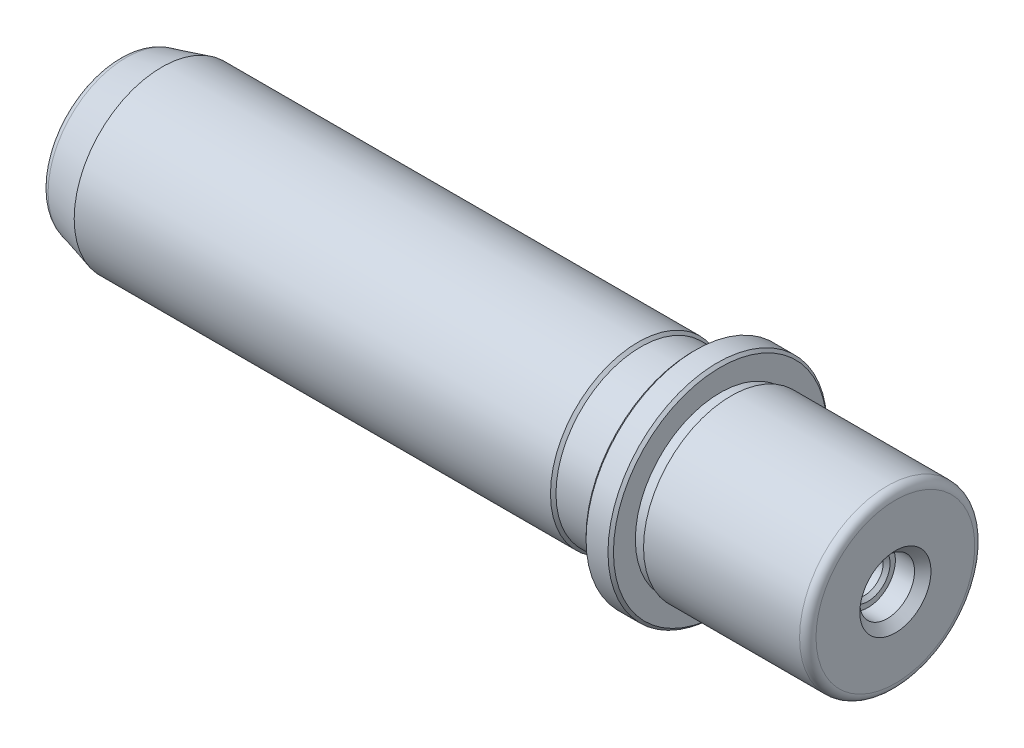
ISO-10303-21;
HEADER;
FILE_DESCRIPTION(('STEP AP214'),'2;1');
FILE_NAME('part.step','',(''),(''),'','','');
FILE_SCHEMA(('AUTOMOTIVE_DESIGN { 1 0 10303 214 1 1 1 1 }'));
ENDSEC;
DATA;
#1=APPLICATION_CONTEXT('core data for automotive mechanical design processes');
#2=APPLICATION_PROTOCOL_DEFINITION('international standard','automotive_design',2000,#1);
#3=PRODUCT_CONTEXT('',#1,'mechanical');
#4=PRODUCT('Part','Part','',(#3));
#5=PRODUCT_RELATED_PRODUCT_CATEGORY('part','',(#4));
#6=PRODUCT_DEFINITION_FORMATION('','',#4);
#7=PRODUCT_DEFINITION_CONTEXT('part definition',#1,'design');
#8=PRODUCT_DEFINITION('design','',#6,#7);
#9=PRODUCT_DEFINITION_SHAPE('','',#8);
#10=(LENGTH_UNIT() NAMED_UNIT(*) SI_UNIT(.MILLI.,.METRE.));
#11=(NAMED_UNIT(*) PLANE_ANGLE_UNIT() SI_UNIT($,.RADIAN.));
#12=(NAMED_UNIT(*) SI_UNIT($,.STERADIAN.) SOLID_ANGLE_UNIT());
#13=UNCERTAINTY_MEASURE_WITH_UNIT(LENGTH_MEASURE(1.E-05),#10,'distance_accuracy_value','');
#14=(GEOMETRIC_REPRESENTATION_CONTEXT(3) GLOBAL_UNCERTAINTY_ASSIGNED_CONTEXT((#13)) GLOBAL_UNIT_ASSIGNED_CONTEXT((#10,
#11,#12)) REPRESENTATION_CONTEXT('',''));
#15=CARTESIAN_POINT('',(0.,0.,0.));
#16=DIRECTION('',(0.,0.,1.));
#17=DIRECTION('',(1.,0.,0.));
#18=AXIS2_PLACEMENT_3D('',#15,#16,#17);
#19=CARTESIAN_POINT('',(110.,0.,0.));
#20=DIRECTION('',(-1.,0.,0.));
#21=DIRECTION('',(0.,0.,1.));
#22=AXIS2_PLACEMENT_3D('',#19,#20,#21);
#23=CONICAL_SURFACE('',#22,19.5,0.785398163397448);
#24=CARTESIAN_POINT('',(109.5,0.,0.));
#25=DIRECTION('',(-1.,0.,0.));
#26=DIRECTION('',(0.,0.,1.));
#27=AXIS2_PLACEMENT_3D('',#24,#25,#26);
#28=CIRCLE('',#27,20.);
#29=CARTESIAN_POINT('',(109.5,0.,20.));
#30=VERTEX_POINT('',#29);
#31=EDGE_CURVE('E77',#30,#30,#28,.T.);
#32=ORIENTED_EDGE('',*,*,#31,.F.);
#33=EDGE_LOOP('',(#32));
#34=FACE_BOUND('',#33,.T.);
#35=CARTESIAN_POINT('',(110.,0.,0.));
#36=DIRECTION('',(-1.,0.,0.));
#37=DIRECTION('',(0.,0.,1.));
#38=AXIS2_PLACEMENT_3D('',#35,#36,#37);
#39=CIRCLE('',#38,19.5);
#40=CARTESIAN_POINT('',(110.,0.,19.5));
#41=VERTEX_POINT('',#40);
#42=EDGE_CURVE('E11',#41,#41,#39,.T.);
#43=ORIENTED_EDGE('',*,*,#42,.T.);
#44=EDGE_LOOP('',(#43));
#45=FACE_BOUND('',#44,.T.);
#46=ADVANCED_FACE('F38',(#34,#45),#23,.T.);
#47=CARTESIAN_POINT('',(110.,19.5,0.));
#48=DIRECTION('',(-1.,0.,0.));
#49=DIRECTION('',(0.,0.,1.));
#50=AXIS2_PLACEMENT_3D('',#47,#48,#49);
#51=PLANE('',#50);
#52=ORIENTED_EDGE('',*,*,#42,.F.);
#53=EDGE_LOOP('',(#52));
#54=FACE_BOUND('',#53,.T.);
#55=CARTESIAN_POINT('',(110.,0.,0.));
#56=DIRECTION('',(-1.,0.,0.));
#57=DIRECTION('',(0.,0.,1.));
#58=AXIS2_PLACEMENT_3D('',#55,#56,#57);
#59=CIRCLE('',#58,15.5);
#60=CARTESIAN_POINT('',(110.,0.,15.5));
#61=VERTEX_POINT('',#60);
#62=EDGE_CURVE('E45',#61,#61,#59,.T.);
#63=ORIENTED_EDGE('',*,*,#62,.T.);
#64=EDGE_LOOP('',(#63));
#65=FACE_BOUND('',#64,.T.);
#66=ADVANCED_FACE('F139',(#54,#65),#51,.F.);
#67=CARTESIAN_POINT('',(0.,0.,0.));
#68=DIRECTION('',(-1.,0.,0.));
#69=DIRECTION('',(0.,0.,1.));
#70=AXIS2_PLACEMENT_3D('',#67,#68,#69);
#71=CYLINDRICAL_SURFACE('',#70,15.5);
#72=ORIENTED_EDGE('',*,*,#62,.F.);
#73=EDGE_LOOP('',(#72));
#74=FACE_BOUND('',#73,.T.);
#75=CARTESIAN_POINT('',(112.,0.,0.));
#76=DIRECTION('',(-1.,0.,0.));
#77=DIRECTION('',(0.,0.,1.));
#78=AXIS2_PLACEMENT_3D('',#75,#76,#77);
#79=CIRCLE('',#78,15.5);
#80=CARTESIAN_POINT('',(112.,0.,15.5));
#81=VERTEX_POINT('',#80);
#82=EDGE_CURVE('E134',#81,#81,#79,.T.);
#83=ORIENTED_EDGE('',*,*,#82,.T.);
#84=EDGE_LOOP('',(#83));
#85=FACE_BOUND('',#84,.T.);
#86=ADVANCED_FACE('F141',(#74,#85),#71,.T.);
#87=CARTESIAN_POINT('',(112.,15.5,0.));
#88=DIRECTION('',(1.,0.,0.));
#89=DIRECTION('',(0.,0.,-1.));
#90=AXIS2_PLACEMENT_3D('',#87,#88,#89);
#91=PLANE('',#90);
#92=ORIENTED_EDGE('',*,*,#82,.F.);
#93=EDGE_LOOP('',(#92));
#94=FACE_BOUND('',#93,.T.);
#95=CARTESIAN_POINT('',(112.,0.,0.));
#96=DIRECTION('',(-1.,0.,0.));
#97=DIRECTION('',(0.,0.,1.));
#98=AXIS2_PLACEMENT_3D('',#95,#96,#97);
#99=CIRCLE('',#98,16.);
#100=CARTESIAN_POINT('',(112.,0.,16.));
#101=VERTEX_POINT('',#100);
#102=EDGE_CURVE('E131',#101,#101,#99,.T.);
#103=ORIENTED_EDGE('',*,*,#102,.T.);
#104=EDGE_LOOP('',(#103));
#105=FACE_BOUND('',#104,.T.);
#106=ADVANCED_FACE('F144',(#94,#105),#91,.F.);
#107=CARTESIAN_POINT('',(0.,0.,0.));
#108=DIRECTION('',(-1.,0.,0.));
#109=DIRECTION('',(0.,0.,1.));
#110=AXIS2_PLACEMENT_3D('',#107,#108,#109);
#111=CYLINDRICAL_SURFACE('',#110,16.);
#112=ORIENTED_EDGE('',*,*,#102,.F.);
#113=EDGE_LOOP('',(#112));
#114=FACE_BOUND('',#113,.T.);
#115=CARTESIAN_POINT('',(140.5,0.,0.));
#116=DIRECTION('',(-1.,0.,0.));
#117=DIRECTION('',(0.,0.,1.));
#118=AXIS2_PLACEMENT_3D('',#115,#116,#117);
#119=CIRCLE('',#118,16.);
#120=CARTESIAN_POINT('',(140.5,0.,16.));
#121=VERTEX_POINT('',#120);
#122=EDGE_CURVE('E128',#121,#121,#119,.T.);
#123=ORIENTED_EDGE('',*,*,#122,.T.);
#124=EDGE_LOOP('',(#123));
#125=FACE_BOUND('',#124,.T.);
#126=ADVANCED_FACE('F150',(#114,#125),#111,.T.);
#127=CARTESIAN_POINT('',(140.5,0.,0.));
#128=DIRECTION('',(-1.,0.,0.));
#129=DIRECTION('',(0.,0.,1.));
#130=AXIS2_PLACEMENT_3D('',#127,#128,#129);
#131=TOROIDAL_SURFACE('',#130,14.5,1.5);
#132=ORIENTED_EDGE('',*,*,#122,.F.);
#133=EDGE_LOOP('',(#132));
#134=FACE_BOUND('',#133,.T.);
#135=CARTESIAN_POINT('',(142.,0.,0.));
#136=DIRECTION('',(-1.,0.,0.));
#137=DIRECTION('',(0.,0.,1.));
#138=AXIS2_PLACEMENT_3D('',#135,#136,#137);
#139=CIRCLE('',#138,14.5);
#140=CARTESIAN_POINT('',(142.,0.,14.5));
#141=VERTEX_POINT('',#140);
#142=EDGE_CURVE('E125',#141,#141,#139,.T.);
#143=ORIENTED_EDGE('',*,*,#142,.T.);
#144=EDGE_LOOP('',(#143));
#145=FACE_BOUND('',#144,.T.);
#146=ADVANCED_FACE('F156',(#134,#145),#131,.T.);
#147=CARTESIAN_POINT('',(142.,14.5,0.));
#148=DIRECTION('',(-1.,0.,0.));
#149=DIRECTION('',(0.,0.,1.));
#150=AXIS2_PLACEMENT_3D('',#147,#148,#149);
#151=PLANE('',#150);
#152=ORIENTED_EDGE('',*,*,#142,.F.);
#153=EDGE_LOOP('',(#152));
#154=FACE_BOUND('',#153,.T.);
#155=CARTESIAN_POINT('',(142.,0.,0.));
#156=DIRECTION('',(-1.,0.,0.));
#157=DIRECTION('',(0.,0.,1.));
#158=AXIS2_PLACEMENT_3D('',#155,#156,#157);
#159=CIRCLE('',#158,6.50000000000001);
#160=CARTESIAN_POINT('',(142.,0.,6.50000000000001));
#161=VERTEX_POINT('',#160);
#162=EDGE_CURVE('E122',#161,#161,#159,.T.);
#163=ORIENTED_EDGE('',*,*,#162,.T.);
#164=EDGE_LOOP('',(#163));
#165=FACE_BOUND('',#164,.T.);
#166=ADVANCED_FACE('F162',(#154,#165),#151,.F.);
#167=CARTESIAN_POINT('',(140.5,0.,0.));
#168=DIRECTION('',(1.,0.,0.));
#169=DIRECTION('',(0.,0.,-1.));
#170=AXIS2_PLACEMENT_3D('',#167,#168,#169);
#171=CONICAL_SURFACE('',#170,5.,0.78539816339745);
#172=ORIENTED_EDGE('',*,*,#162,.F.);
#173=EDGE_LOOP('',(#172));
#174=FACE_BOUND('',#173,.T.);
#175=CARTESIAN_POINT('',(140.5,0.,0.));
#176=DIRECTION('',(-1.,0.,0.));
#177=DIRECTION('',(0.,0.,1.));
#178=AXIS2_PLACEMENT_3D('',#175,#176,#177);
#179=CIRCLE('',#178,5.);
#180=CARTESIAN_POINT('',(140.5,0.,5.));
#181=VERTEX_POINT('',#180);
#182=EDGE_CURVE('E119',#181,#181,#179,.T.);
#183=ORIENTED_EDGE('',*,*,#182,.T.);
#184=EDGE_LOOP('',(#183));
#185=FACE_BOUND('',#184,.T.);
#186=ADVANCED_FACE('F168',(#174,#185),#171,.F.);
#187=CARTESIAN_POINT('',(0.,0.,0.));
#188=DIRECTION('',(-1.,0.,0.));
#189=DIRECTION('',(0.,0.,1.));
#190=AXIS2_PLACEMENT_3D('',#187,#188,#189);
#191=CYLINDRICAL_SURFACE('',#190,5.);
#192=ORIENTED_EDGE('',*,*,#182,.F.);
#193=EDGE_LOOP('',(#192));
#194=FACE_BOUND('',#193,.T.);
#195=CARTESIAN_POINT('',(137.,0.,0.));
#196=DIRECTION('',(-1.,0.,0.));
#197=DIRECTION('',(0.,0.,1.));
#198=AXIS2_PLACEMENT_3D('',#195,#196,#197);
#199=CIRCLE('',#198,5.);
#200=CARTESIAN_POINT('',(137.,0.,5.));
#201=VERTEX_POINT('',#200);
#202=EDGE_CURVE('E116',#201,#201,#199,.T.);
#203=ORIENTED_EDGE('',*,*,#202,.T.);
#204=EDGE_LOOP('',(#203));
#205=FACE_BOUND('',#204,.T.);
#206=ADVANCED_FACE('F174',(#194,#205),#191,.F.);
#207=CARTESIAN_POINT('',(137.,0.,0.));
#208=DIRECTION('',(-1.,0.,0.));
#209=DIRECTION('',(0.,0.,1.));
#210=AXIS2_PLACEMENT_3D('',#207,#208,#209);
#211=PLANE('',#210);
#212=CARTESIAN_POINT('',(137.,0.,0.));
#213=DIRECTION('',(1.,0.,0.));
#214=DIRECTION('',(0.,0.,-1.));
#215=AXIS2_PLACEMENT_3D('',#212,#213,#214);
#216=CIRCLE('',#215,4.025);
#217=CARTESIAN_POINT('',(137.,0.,-4.025));
#218=VERTEX_POINT('',#217);
#219=EDGE_CURVE('E61',#218,#218,#216,.T.);
#220=ORIENTED_EDGE('',*,*,#219,.F.);
#221=EDGE_LOOP('',(#220));
#222=FACE_BOUND('',#221,.T.);
#223=ORIENTED_EDGE('',*,*,#202,.F.);
#224=EDGE_LOOP('',(#223));
#225=FACE_BOUND('',#224,.T.);
#226=ADVANCED_FACE('F180',(#222,#225),#211,.F.);
#227=CARTESIAN_POINT('',(5.,0.,0.));
#228=DIRECTION('',(1.,0.,0.));
#229=DIRECTION('',(0.,0.,-1.));
#230=AXIS2_PLACEMENT_3D('',#227,#228,#229);
#231=PLANE('',#230);
#232=CARTESIAN_POINT('',(5.,0.,0.));
#233=DIRECTION('',(-1.,0.,0.));
#234=DIRECTION('',(0.,0.,1.));
#235=AXIS2_PLACEMENT_3D('',#232,#233,#234);
#236=CIRCLE('',#235,4.025);
#237=CARTESIAN_POINT('',(5.,0.,4.025));
#238=VERTEX_POINT('',#237);
#239=EDGE_CURVE('E68',#238,#238,#236,.T.);
#240=ORIENTED_EDGE('',*,*,#239,.F.);
#241=EDGE_LOOP('',(#240));
#242=FACE_BOUND('',#241,.T.);
#243=CARTESIAN_POINT('',(5.,0.,0.));
#244=DIRECTION('',(-1.,0.,0.));
#245=DIRECTION('',(0.,0.,1.));
#246=AXIS2_PLACEMENT_3D('',#243,#244,#245);
#247=CIRCLE('',#246,5.);
#248=CARTESIAN_POINT('',(5.,0.,5.));
#249=VERTEX_POINT('',#248);
#250=EDGE_CURVE('E113',#249,#249,#247,.T.);
#251=ORIENTED_EDGE('',*,*,#250,.T.);
#252=EDGE_LOOP('',(#251));
#253=FACE_BOUND('',#252,.T.);
#254=ADVANCED_FACE('F185',(#242,#253),#231,.F.);
#255=CARTESIAN_POINT('',(0.,0.,0.));
#256=DIRECTION('',(-1.,0.,0.));
#257=DIRECTION('',(0.,0.,1.));
#258=AXIS2_PLACEMENT_3D('',#255,#256,#257);
#259=CYLINDRICAL_SURFACE('',#258,5.);
#260=ORIENTED_EDGE('',*,*,#250,.F.);
#261=EDGE_LOOP('',(#260));
#262=FACE_BOUND('',#261,.T.);
#263=CARTESIAN_POINT('',(1.5,0.,0.));
#264=DIRECTION('',(-1.,0.,0.));
#265=DIRECTION('',(0.,0.,1.));
#266=AXIS2_PLACEMENT_3D('',#263,#264,#265);
#267=CIRCLE('',#266,5.);
#268=CARTESIAN_POINT('',(1.5,0.,5.));
#269=VERTEX_POINT('',#268);
#270=EDGE_CURVE('E110',#269,#269,#267,.T.);
#271=ORIENTED_EDGE('',*,*,#270,.T.);
#272=EDGE_LOOP('',(#271));
#273=FACE_BOUND('',#272,.T.);
#274=ADVANCED_FACE('F191',(#262,#273),#259,.F.);
#275=CARTESIAN_POINT('',(0.,0.,0.));
#276=DIRECTION('',(-1.,0.,0.));
#277=DIRECTION('',(0.,0.,1.));
#278=AXIS2_PLACEMENT_3D('',#275,#276,#277);
#279=CONICAL_SURFACE('',#278,6.5,0.78539816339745);
#280=ORIENTED_EDGE('',*,*,#270,.F.);
#281=EDGE_LOOP('',(#280));
#282=FACE_BOUND('',#281,.T.);
#283=CARTESIAN_POINT('',(0.,0.,0.));
#284=DIRECTION('',(-1.,0.,0.));
#285=DIRECTION('',(0.,0.,1.));
#286=AXIS2_PLACEMENT_3D('',#283,#284,#285);
#287=CIRCLE('',#286,6.5);
#288=CARTESIAN_POINT('',(0.,0.,6.5));
#289=VERTEX_POINT('',#288);
#290=EDGE_CURVE('E107',#289,#289,#287,.T.);
#291=ORIENTED_EDGE('',*,*,#290,.T.);
#292=EDGE_LOOP('',(#291));
#293=FACE_BOUND('',#292,.T.);
#294=ADVANCED_FACE('F253',(#282,#293),#279,.F.);
#295=CARTESIAN_POINT('',(0.,6.5,0.));
#296=DIRECTION('',(1.,0.,0.));
#297=DIRECTION('',(0.,0.,-1.));
#298=AXIS2_PLACEMENT_3D('',#295,#296,#297);
#299=PLANE('',#298);
#300=ORIENTED_EDGE('',*,*,#290,.F.);
#301=EDGE_LOOP('',(#300));
#302=FACE_BOUND('',#301,.T.);
#303=CARTESIAN_POINT('',(0.,0.,0.));
#304=DIRECTION('',(-1.,0.,0.));
#305=DIRECTION('',(0.,0.,1.));
#306=AXIS2_PLACEMENT_3D('',#303,#304,#305);
#307=CIRCLE('',#306,12.3217524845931);
#308=CARTESIAN_POINT('',(0.,0.,12.3217524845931));
#309=VERTEX_POINT('',#308);
#310=EDGE_CURVE('E104',#309,#309,#307,.T.);
#311=ORIENTED_EDGE('',*,*,#310,.T.);
#312=EDGE_LOOP('',(#311));
#313=FACE_BOUND('',#312,.T.);
#314=ADVANCED_FACE('F249',(#302,#313),#299,.F.);
#315=CARTESIAN_POINT('',(2.,0.,0.));
#316=DIRECTION('',(-1.,0.,0.));
#317=DIRECTION('',(0.,0.,1.));
#318=AXIS2_PLACEMENT_3D('',#315,#316,#317);
#319=TOROIDAL_SURFACE('',#318,12.3217524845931,2.);
#320=ORIENTED_EDGE('',*,*,#310,.F.);
#321=EDGE_LOOP('',(#320));
#322=FACE_BOUND('',#321,.T.);
#323=CARTESIAN_POINT('',(1.48236190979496,0.,0.));
#324=DIRECTION('',(-1.,0.,0.));
#325=DIRECTION('',(0.,0.,1.));
#326=AXIS2_PLACEMENT_3D('',#323,#324,#325);
#327=CIRCLE('',#326,14.2536041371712);
#328=CARTESIAN_POINT('',(1.48236190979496,0.,14.2536041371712));
#329=VERTEX_POINT('',#328);
#330=EDGE_CURVE('E101',#329,#329,#327,.T.);
#331=ORIENTED_EDGE('',*,*,#330,.T.);
#332=EDGE_LOOP('',(#331));
#333=FACE_BOUND('',#332,.T.);
#334=ADVANCED_FACE('F245',(#322,#333),#319,.T.);
#335=CARTESIAN_POINT('',(8.,0.,0.));
#336=DIRECTION('',(1.,0.,0.));
#337=DIRECTION('',(0.,0.,-1.));
#338=AXIS2_PLACEMENT_3D('',#335,#336,#337);
#339=CONICAL_SURFACE('',#338,16.,0.261799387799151);
#340=ORIENTED_EDGE('',*,*,#330,.F.);
#341=EDGE_LOOP('',(#340));
#342=FACE_BOUND('',#341,.T.);
#343=CARTESIAN_POINT('',(8.,0.,0.));
#344=DIRECTION('',(-1.,0.,0.));
#345=DIRECTION('',(0.,0.,1.));
#346=AXIS2_PLACEMENT_3D('',#343,#344,#345);
#347=CIRCLE('',#346,16.);
#348=CARTESIAN_POINT('',(8.,0.,16.));
#349=VERTEX_POINT('',#348);
#350=EDGE_CURVE('E98',#349,#349,#347,.T.);
#351=ORIENTED_EDGE('',*,*,#350,.T.);
#352=EDGE_LOOP('',(#351));
#353=FACE_BOUND('',#352,.T.);
#354=ADVANCED_FACE('F241',(#342,#353),#339,.T.);
#355=CARTESIAN_POINT('',(0.,0.,0.));
#356=DIRECTION('',(-1.,0.,0.));
#357=DIRECTION('',(0.,0.,1.));
#358=AXIS2_PLACEMENT_3D('',#355,#356,#357);
#359=CYLINDRICAL_SURFACE('',#358,16.);
#360=ORIENTED_EDGE('',*,*,#350,.F.);
#361=EDGE_LOOP('',(#360));
#362=FACE_BOUND('',#361,.T.);
#363=CARTESIAN_POINT('',(95.,0.,0.));
#364=DIRECTION('',(-1.,0.,0.));
#365=DIRECTION('',(0.,0.,1.));
#366=AXIS2_PLACEMENT_3D('',#363,#364,#365);
#367=CIRCLE('',#366,16.);
#368=CARTESIAN_POINT('',(95.,0.,16.));
#369=VERTEX_POINT('',#368);
#370=EDGE_CURVE('E95',#369,#369,#367,.T.);
#371=ORIENTED_EDGE('',*,*,#370,.T.);
#372=EDGE_LOOP('',(#371));
#373=FACE_BOUND('',#372,.T.);
#374=ADVANCED_FACE('F237',(#362,#373),#359,.T.);
#375=CARTESIAN_POINT('',(95.5,0.,0.));
#376=DIRECTION('',(-1.,0.,0.));
#377=DIRECTION('',(0.,0.,1.));
#378=AXIS2_PLACEMENT_3D('',#375,#376,#377);
#379=CONICAL_SURFACE('',#378,15.5,0.785398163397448);
#380=ORIENTED_EDGE('',*,*,#370,.F.);
#381=EDGE_LOOP('',(#380));
#382=FACE_BOUND('',#381,.T.);
#383=CARTESIAN_POINT('',(95.5,0.,0.));
#384=DIRECTION('',(-1.,0.,0.));
#385=DIRECTION('',(0.,0.,1.));
#386=AXIS2_PLACEMENT_3D('',#383,#384,#385);
#387=CIRCLE('',#386,15.5);
#388=CARTESIAN_POINT('',(95.5,0.,15.5));
#389=VERTEX_POINT('',#388);
#390=EDGE_CURVE('E92',#389,#389,#387,.T.);
#391=ORIENTED_EDGE('',*,*,#390,.T.);
#392=EDGE_LOOP('',(#391));
#393=FACE_BOUND('',#392,.T.);
#394=ADVANCED_FACE('F233',(#382,#393),#379,.T.);
#395=CARTESIAN_POINT('',(0.,0.,0.));
#396=DIRECTION('',(-1.,0.,0.));
#397=DIRECTION('',(0.,0.,1.));
#398=AXIS2_PLACEMENT_3D('',#395,#396,#397);
#399=CYLINDRICAL_SURFACE('',#398,15.5);
#400=ORIENTED_EDGE('',*,*,#390,.F.);
#401=EDGE_LOOP('',(#400));
#402=FACE_BOUND('',#401,.T.);
#403=CARTESIAN_POINT('',(104.5,0.,0.));
#404=DIRECTION('',(-1.,0.,0.));
#405=DIRECTION('',(0.,0.,1.));
#406=AXIS2_PLACEMENT_3D('',#403,#404,#405);
#407=CIRCLE('',#406,15.5);
#408=CARTESIAN_POINT('',(104.5,0.,15.5));
#409=VERTEX_POINT('',#408);
#410=EDGE_CURVE('E89',#409,#409,#407,.T.);
#411=ORIENTED_EDGE('',*,*,#410,.T.);
#412=EDGE_LOOP('',(#411));
#413=FACE_BOUND('',#412,.T.);
#414=ADVANCED_FACE('F229',(#402,#413),#399,.T.);
#415=CARTESIAN_POINT('',(105.,0.,0.));
#416=DIRECTION('',(1.,0.,0.));
#417=DIRECTION('',(0.,0.,-1.));
#418=AXIS2_PLACEMENT_3D('',#415,#416,#417);
#419=CONICAL_SURFACE('',#418,16.,0.785398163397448);
#420=ORIENTED_EDGE('',*,*,#410,.F.);
#421=EDGE_LOOP('',(#420));
#422=FACE_BOUND('',#421,.T.);
#423=CARTESIAN_POINT('',(105.,0.,0.));
#424=DIRECTION('',(-1.,0.,0.));
#425=DIRECTION('',(0.,0.,1.));
#426=AXIS2_PLACEMENT_3D('',#423,#424,#425);
#427=CIRCLE('',#426,16.);
#428=CARTESIAN_POINT('',(105.,0.,16.));
#429=VERTEX_POINT('',#428);
#430=EDGE_CURVE('E86',#429,#429,#427,.T.);
#431=ORIENTED_EDGE('',*,*,#430,.T.);
#432=EDGE_LOOP('',(#431));
#433=FACE_BOUND('',#432,.T.);
#434=ADVANCED_FACE('F225',(#422,#433),#419,.T.);
#435=CARTESIAN_POINT('',(105.,19.5,0.));
#436=DIRECTION('',(1.,0.,0.));
#437=DIRECTION('',(0.,0.,-1.));
#438=AXIS2_PLACEMENT_3D('',#435,#436,#437);
#439=PLANE('',#438);
#440=ORIENTED_EDGE('',*,*,#430,.F.);
#441=EDGE_LOOP('',(#440));
#442=FACE_BOUND('',#441,.T.);
#443=CARTESIAN_POINT('',(105.,0.,0.));
#444=DIRECTION('',(-1.,0.,0.));
#445=DIRECTION('',(0.,0.,1.));
#446=AXIS2_PLACEMENT_3D('',#443,#444,#445);
#447=CIRCLE('',#446,19.5);
#448=CARTESIAN_POINT('',(105.,0.,19.5));
#449=VERTEX_POINT('',#448);
#450=EDGE_CURVE('E83',#449,#449,#447,.T.);
#451=ORIENTED_EDGE('',*,*,#450,.T.);
#452=EDGE_LOOP('',(#451));
#453=FACE_BOUND('',#452,.T.);
#454=ADVANCED_FACE('F217',(#442,#453),#439,.F.);
#455=CARTESIAN_POINT('',(105.5,0.,0.));
#456=DIRECTION('',(1.,0.,0.));
#457=DIRECTION('',(0.,0.,-1.));
#458=AXIS2_PLACEMENT_3D('',#455,#456,#457);
#459=CONICAL_SURFACE('',#458,20.,0.785398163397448);
#460=ORIENTED_EDGE('',*,*,#450,.F.);
#461=EDGE_LOOP('',(#460));
#462=FACE_BOUND('',#461,.T.);
#463=CARTESIAN_POINT('',(105.5,0.,0.));
#464=DIRECTION('',(-1.,0.,0.));
#465=DIRECTION('',(0.,0.,1.));
#466=AXIS2_PLACEMENT_3D('',#463,#464,#465);
#467=CIRCLE('',#466,20.);
#468=CARTESIAN_POINT('',(105.5,0.,20.));
#469=VERTEX_POINT('',#468);
#470=EDGE_CURVE('E80',#469,#469,#467,.T.);
#471=ORIENTED_EDGE('',*,*,#470,.T.);
#472=EDGE_LOOP('',(#471));
#473=FACE_BOUND('',#472,.T.);
#474=ADVANCED_FACE('F208',(#462,#473),#459,.T.);
#475=CARTESIAN_POINT('',(0.,0.,0.));
#476=DIRECTION('',(-1.,0.,0.));
#477=DIRECTION('',(0.,0.,1.));
#478=AXIS2_PLACEMENT_3D('',#475,#476,#477);
#479=CYLINDRICAL_SURFACE('',#478,20.);
#480=ORIENTED_EDGE('',*,*,#470,.F.);
#481=EDGE_LOOP('',(#480));
#482=FACE_BOUND('',#481,.T.);
#483=ORIENTED_EDGE('',*,*,#31,.T.);
#484=EDGE_LOOP('',(#483));
#485=FACE_BOUND('',#484,.T.);
#486=ADVANCED_FACE('F205',(#482,#485),#479,.T.);
#487=CARTESIAN_POINT('',(114.75,0.,0.));
#488=DIRECTION('',(1.,0.,0.));
#489=DIRECTION('',(0.,0.,-1.));
#490=AXIS2_PLACEMENT_3D('',#487,#488,#489);
#491=CONICAL_SURFACE('',#490,3.39999999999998,1.02974425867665);
#492=CARTESIAN_POINT('',(112.707073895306,0.,0.));
#493=VERTEX_POINT('',#492);
#494=VERTEX_LOOP('',#493);
#495=FACE_BOUND('',#494,.T.);
#496=CARTESIAN_POINT('',(114.75,0.,0.));
#497=DIRECTION('',(1.,0.,0.));
#498=DIRECTION('',(0.,0.,-1.));
#499=AXIS2_PLACEMENT_3D('',#496,#497,#498);
#500=CIRCLE('',#499,3.39999999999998);
#501=CARTESIAN_POINT('',(114.75,0.,-3.39999999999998));
#502=VERTEX_POINT('',#501);
#503=EDGE_CURVE('E74',#502,#502,#500,.T.);
#504=ORIENTED_EDGE('',*,*,#503,.T.);
#505=EDGE_LOOP('',(#504));
#506=FACE_BOUND('',#505,.T.);
#507=ADVANCED_FACE('F207',(#495,#506),#491,.F.);
#508=CARTESIAN_POINT('',(137.,0.,0.));
#509=DIRECTION('',(1.,0.,0.));
#510=DIRECTION('',(0.,0.,-1.));
#511=AXIS2_PLACEMENT_3D('',#508,#509,#510);
#512=CYLINDRICAL_SURFACE('',#511,3.39999999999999);
#513=ORIENTED_EDGE('',*,*,#503,.F.);
#514=EDGE_LOOP('',(#513));
#515=FACE_BOUND('',#514,.T.);
#516=CARTESIAN_POINT('',(136.375,0.,0.));
#517=DIRECTION('',(1.,0.,0.));
#518=DIRECTION('',(0.,0.,-1.));
#519=AXIS2_PLACEMENT_3D('',#516,#517,#518);
#520=CIRCLE('',#519,3.4);
#521=CARTESIAN_POINT('',(136.375,0.,-3.4));
#522=VERTEX_POINT('',#521);
#523=EDGE_CURVE('E65',#522,#522,#520,.T.);
#524=ORIENTED_EDGE('',*,*,#523,.T.);
#525=EDGE_LOOP('',(#524));
#526=FACE_BOUND('',#525,.T.);
#527=ADVANCED_FACE('F215',(#515,#526),#512,.F.);
#528=CARTESIAN_POINT('',(137.,0.,0.));
#529=DIRECTION('',(1.,0.,0.));
#530=DIRECTION('',(0.,0.,-1.));
#531=AXIS2_PLACEMENT_3D('',#528,#529,#530);
#532=CONICAL_SURFACE('',#531,4.025,0.78539816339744);
#533=ORIENTED_EDGE('',*,*,#523,.F.);
#534=EDGE_LOOP('',(#533));
#535=FACE_BOUND('',#534,.T.);
#536=ORIENTED_EDGE('',*,*,#219,.T.);
#537=EDGE_LOOP('',(#536));
#538=FACE_BOUND('',#537,.T.);
#539=ADVANCED_FACE('F55',(#535,#538),#532,.F.);
#540=CARTESIAN_POINT('',(27.25,0.,0.));
#541=DIRECTION('',(-1.,0.,0.));
#542=DIRECTION('',(0.,0.,1.));
#543=AXIS2_PLACEMENT_3D('',#540,#541,#542);
#544=CONICAL_SURFACE('',#543,3.39999999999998,1.02974425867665);
#545=CARTESIAN_POINT('',(29.2929261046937,0.,0.));
#546=VERTEX_POINT('',#545);
#547=VERTEX_LOOP('',#546);
#548=FACE_BOUND('',#547,.T.);
#549=CARTESIAN_POINT('',(27.25,0.,0.));
#550=DIRECTION('',(-1.,0.,0.));
#551=DIRECTION('',(0.,0.,1.));
#552=AXIS2_PLACEMENT_3D('',#549,#550,#551);
#553=CIRCLE('',#552,3.39999999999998);
#554=CARTESIAN_POINT('',(27.25,0.,3.39999999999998));
#555=VERTEX_POINT('',#554);
#556=EDGE_CURVE('E59',#555,#555,#553,.T.);
#557=ORIENTED_EDGE('',*,*,#556,.T.);
#558=EDGE_LOOP('',(#557));
#559=FACE_BOUND('',#558,.T.);
#560=ADVANCED_FACE('F51',(#548,#559),#544,.F.);
#561=CARTESIAN_POINT('',(5.,0.,0.));
#562=DIRECTION('',(-1.,0.,0.));
#563=DIRECTION('',(0.,0.,1.));
#564=AXIS2_PLACEMENT_3D('',#561,#562,#563);
#565=CYLINDRICAL_SURFACE('',#564,3.39999999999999);
#566=ORIENTED_EDGE('',*,*,#556,.F.);
#567=EDGE_LOOP('',(#566));
#568=FACE_BOUND('',#567,.T.);
#569=CARTESIAN_POINT('',(5.625,0.,0.));
#570=DIRECTION('',(-1.,0.,0.));
#571=DIRECTION('',(0.,0.,1.));
#572=AXIS2_PLACEMENT_3D('',#569,#570,#571);
#573=CIRCLE('',#572,3.4);
#574=CARTESIAN_POINT('',(5.625,0.,3.4));
#575=VERTEX_POINT('',#574);
#576=EDGE_CURVE('E62',#575,#575,#573,.T.);
#577=ORIENTED_EDGE('',*,*,#576,.T.);
#578=EDGE_LOOP('',(#577));
#579=FACE_BOUND('',#578,.T.);
#580=ADVANCED_FACE('F54',(#568,#579),#565,.F.);
#581=CARTESIAN_POINT('',(5.,0.,0.));
#582=DIRECTION('',(-1.,0.,0.));
#583=DIRECTION('',(0.,0.,1.));
#584=AXIS2_PLACEMENT_3D('',#581,#582,#583);
#585=CONICAL_SURFACE('',#584,4.025,0.785398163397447);
#586=ORIENTED_EDGE('',*,*,#576,.F.);
#587=EDGE_LOOP('',(#586));
#588=FACE_BOUND('',#587,.T.);
#589=ORIENTED_EDGE('',*,*,#239,.T.);
#590=EDGE_LOOP('',(#589));
#591=FACE_BOUND('',#590,.T.);
#592=ADVANCED_FACE('F385',(#588,#591),#585,.F.);
#593=CLOSED_SHELL('',(#46,#66,#86,#106,#126,#146,#166,#186,#206,#226,#254,#274,#294,#314,#334,
#354,#374,#394,#414,#434,#454,#474,#486,#507,#527,#539,#560,#580,#592));
#594=MANIFOLD_SOLID_BREP('B2',#593);
#595=ADVANCED_BREP_SHAPE_REPRESENTATION('',(#18,#594),#14);
#596=SHAPE_DEFINITION_REPRESENTATION(#9,#595);
ENDSEC;
END-ISO-10303-21;
